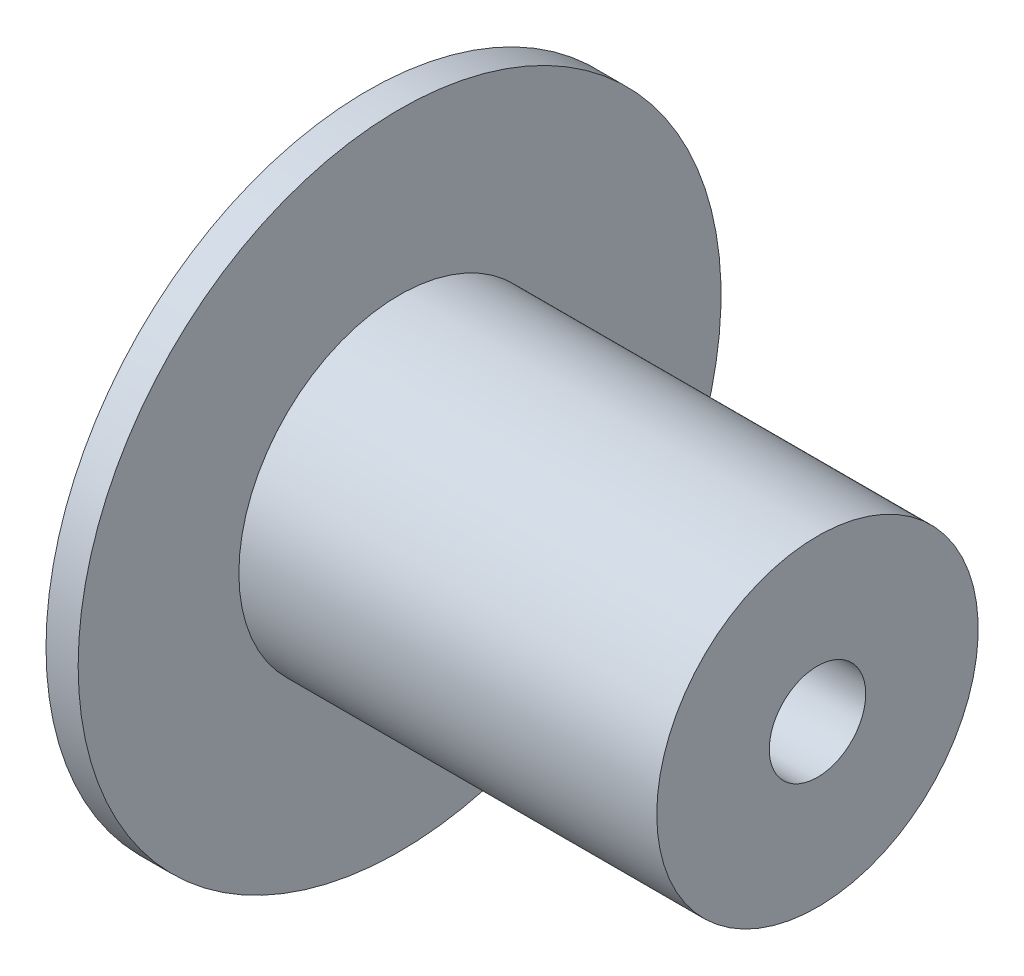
from build123d import *

# Parameters (mm, degrees)
SKETCH2_R      = 1.5
EXTRUDE1_DEPTH = 10


with BuildPart() as part:
    # Sketch1 → Revolve1 (revolve)
    with BuildSketch(Plane.XY, mode=Mode.PRIVATE) as revolve1_sk:
        Polygon((0, 0), (0, 10), (1, 10), (1, 5), (14, 5), (14, 0), align=None)
    revolve(revolve1_sk.sketch.rotate(Axis((0, 0, 0), (1, 0, 0)), 90), axis=Axis((0, 0, 0), (1, 0, 0)))

    # Sketch2 → Extrude1 (cut)
    with BuildSketch(Plane(origin=(14, 0, 0), x_dir=(0, 0, -1), z_dir=(1, 0, 0))):
        Circle(SKETCH2_R)
    extrude(amount=-EXTRUDE1_DEPTH, mode=Mode.SUBTRACT)


solid = part.part
